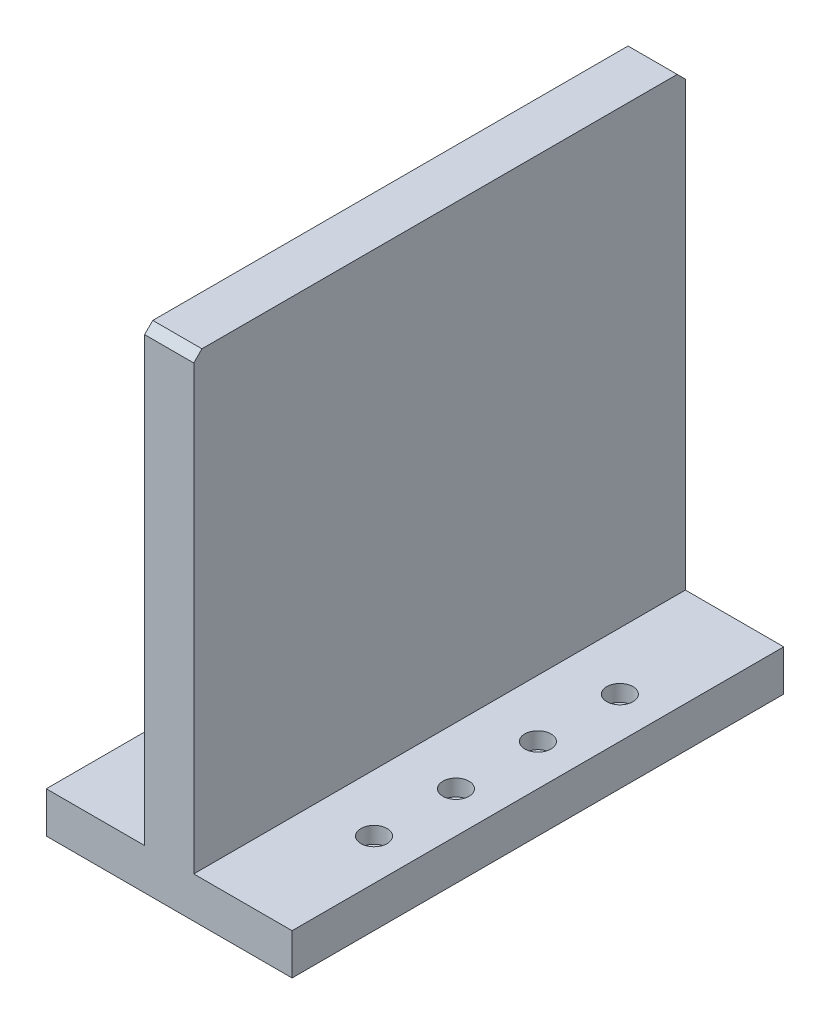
ISO-10303-21;
HEADER;
FILE_DESCRIPTION(('STEP AP214'),'2;1');
FILE_NAME('part.step','',(''),(''),'','','');
FILE_SCHEMA(('AUTOMOTIVE_DESIGN { 1 0 10303 214 1 1 1 1 }'));
ENDSEC;
DATA;
#1=APPLICATION_CONTEXT('core data for automotive mechanical design processes');
#2=APPLICATION_PROTOCOL_DEFINITION('international standard','automotive_design',2000,#1);
#3=PRODUCT_CONTEXT('',#1,'mechanical');
#4=PRODUCT('Part','Part','',(#3));
#5=PRODUCT_RELATED_PRODUCT_CATEGORY('part','',(#4));
#6=PRODUCT_DEFINITION_FORMATION('','',#4);
#7=PRODUCT_DEFINITION_CONTEXT('part definition',#1,'design');
#8=PRODUCT_DEFINITION('design','',#6,#7);
#9=PRODUCT_DEFINITION_SHAPE('','',#8);
#10=(LENGTH_UNIT() NAMED_UNIT(*) SI_UNIT(.MILLI.,.METRE.));
#11=(NAMED_UNIT(*) PLANE_ANGLE_UNIT() SI_UNIT($,.RADIAN.));
#12=(NAMED_UNIT(*) SI_UNIT($,.STERADIAN.) SOLID_ANGLE_UNIT());
#13=UNCERTAINTY_MEASURE_WITH_UNIT(LENGTH_MEASURE(1.E-05),#10,'distance_accuracy_value','');
#14=(GEOMETRIC_REPRESENTATION_CONTEXT(3) GLOBAL_UNCERTAINTY_ASSIGNED_CONTEXT((#13)) GLOBAL_UNIT_ASSIGNED_CONTEXT((#10,
#11,#12)) REPRESENTATION_CONTEXT('',''));
#15=CARTESIAN_POINT('',(0.,0.,0.));
#16=DIRECTION('',(0.,0.,1.));
#17=DIRECTION('',(1.,0.,0.));
#18=AXIS2_PLACEMENT_3D('',#15,#16,#17);
#19=CARTESIAN_POINT('',(-50.,30.,75.));
#20=DIRECTION('',(0.,-1.,0.));
#21=DIRECTION('',(0.,0.,-1.));
#22=AXIS2_PLACEMENT_3D('',#19,#20,#21);
#23=CYLINDRICAL_SURFACE('',#22,5.00000000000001);
#24=CARTESIAN_POINT('',(-50.,0.,75.));
#25=DIRECTION('',(0.,1.,0.));
#26=DIRECTION('',(0.,0.,1.));
#27=AXIS2_PLACEMENT_3D('',#24,#25,#26);
#28=CIRCLE('',#27,5.00000000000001);
#29=CARTESIAN_POINT('',(-50.,0.,80.));
#30=VERTEX_POINT('',#29);
#31=EDGE_CURVE('E193',#30,#30,#28,.T.);
#32=ORIENTED_EDGE('',*,*,#31,.F.);
#33=EDGE_LOOP('',(#32));
#34=FACE_BOUND('',#33,.T.);
#35=CARTESIAN_POINT('',(-50.,15.,75.));
#36=DIRECTION('',(0.,1.,0.));
#37=DIRECTION('',(-1.,0.,0.));
#38=AXIS2_PLACEMENT_3D('',#35,#36,#37);
#39=CIRCLE('',#38,5.00000000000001);
#40=CARTESIAN_POINT('',(-55.,15.,75.));
#41=VERTEX_POINT('',#40);
#42=EDGE_CURVE('E37',#41,#41,#39,.T.);
#43=ORIENTED_EDGE('',*,*,#42,.T.);
#44=EDGE_LOOP('',(#43));
#45=FACE_BOUND('',#44,.T.);
#46=ADVANCED_FACE('F33',(#34,#45),#23,.F.);
#47=CARTESIAN_POINT('',(50.,30.,75.));
#48=DIRECTION('',(0.,-1.,0.));
#49=DIRECTION('',(0.,0.,-1.));
#50=AXIS2_PLACEMENT_3D('',#47,#48,#49);
#51=CYLINDRICAL_SURFACE('',#50,5.);
#52=CARTESIAN_POINT('',(50.,0.,75.));
#53=DIRECTION('',(0.,1.,0.));
#54=DIRECTION('',(0.,0.,1.));
#55=AXIS2_PLACEMENT_3D('',#52,#53,#54);
#56=CIRCLE('',#55,5.);
#57=CARTESIAN_POINT('',(50.,0.,80.));
#58=VERTEX_POINT('',#57);
#59=EDGE_CURVE('E157',#58,#58,#56,.T.);
#60=ORIENTED_EDGE('',*,*,#59,.F.);
#61=EDGE_LOOP('',(#60));
#62=FACE_BOUND('',#61,.T.);
#63=CARTESIAN_POINT('',(50.,15.,75.));
#64=DIRECTION('',(0.,1.,0.));
#65=DIRECTION('',(-1.,0.,0.));
#66=AXIS2_PLACEMENT_3D('',#63,#64,#65);
#67=CIRCLE('',#66,5.);
#68=CARTESIAN_POINT('',(45.,15.,75.));
#69=VERTEX_POINT('',#68);
#70=EDGE_CURVE('E174',#69,#69,#67,.T.);
#71=ORIENTED_EDGE('',*,*,#70,.T.);
#72=EDGE_LOOP('',(#71));
#73=FACE_BOUND('',#72,.T.);
#74=ADVANCED_FACE('F280',(#62,#73),#51,.F.);
#75=CARTESIAN_POINT('',(50.,30.,125.));
#76=DIRECTION('',(0.,-1.,0.));
#77=DIRECTION('',(0.,0.,-1.));
#78=AXIS2_PLACEMENT_3D('',#75,#76,#77);
#79=CYLINDRICAL_SURFACE('',#78,5.00000000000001);
#80=CARTESIAN_POINT('',(50.,0.,125.));
#81=DIRECTION('',(0.,1.,0.));
#82=DIRECTION('',(0.,0.,1.));
#83=AXIS2_PLACEMENT_3D('',#80,#81,#82);
#84=CIRCLE('',#83,5.00000000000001);
#85=CARTESIAN_POINT('',(50.,0.,130.));
#86=VERTEX_POINT('',#85);
#87=EDGE_CURVE('E206',#86,#86,#84,.T.);
#88=ORIENTED_EDGE('',*,*,#87,.F.);
#89=EDGE_LOOP('',(#88));
#90=FACE_BOUND('',#89,.T.);
#91=CARTESIAN_POINT('',(50.,15.,125.));
#92=DIRECTION('',(0.,1.,0.));
#93=DIRECTION('',(-1.,0.,0.));
#94=AXIS2_PLACEMENT_3D('',#91,#92,#93);
#95=CIRCLE('',#94,5.00000000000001);
#96=CARTESIAN_POINT('',(45.,15.,125.));
#97=VERTEX_POINT('',#96);
#98=EDGE_CURVE('E172',#97,#97,#95,.T.);
#99=ORIENTED_EDGE('',*,*,#98,.T.);
#100=EDGE_LOOP('',(#99));
#101=FACE_BOUND('',#100,.T.);
#102=ADVANCED_FACE('F286',(#90,#101),#79,.F.);
#103=CARTESIAN_POINT('',(50.,30.,175.));
#104=DIRECTION('',(0.,-1.,0.));
#105=DIRECTION('',(0.,0.,-1.));
#106=AXIS2_PLACEMENT_3D('',#103,#104,#105);
#107=CYLINDRICAL_SURFACE('',#106,5.00000000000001);
#108=CARTESIAN_POINT('',(50.,0.,175.));
#109=DIRECTION('',(0.,1.,0.));
#110=DIRECTION('',(0.,0.,1.));
#111=AXIS2_PLACEMENT_3D('',#108,#109,#110);
#112=CIRCLE('',#111,5.00000000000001);
#113=CARTESIAN_POINT('',(50.,0.,180.));
#114=VERTEX_POINT('',#113);
#115=EDGE_CURVE('E203',#114,#114,#112,.T.);
#116=ORIENTED_EDGE('',*,*,#115,.F.);
#117=EDGE_LOOP('',(#116));
#118=FACE_BOUND('',#117,.T.);
#119=CARTESIAN_POINT('',(50.,15.,175.));
#120=DIRECTION('',(0.,1.,0.));
#121=DIRECTION('',(-1.,0.,0.));
#122=AXIS2_PLACEMENT_3D('',#119,#120,#121);
#123=CIRCLE('',#122,5.00000000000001);
#124=CARTESIAN_POINT('',(45.,15.,175.));
#125=VERTEX_POINT('',#124);
#126=EDGE_CURVE('E169',#125,#125,#123,.T.);
#127=ORIENTED_EDGE('',*,*,#126,.T.);
#128=EDGE_LOOP('',(#127));
#129=FACE_BOUND('',#128,.T.);
#130=ADVANCED_FACE('F543',(#118,#129),#107,.F.);
#131=CARTESIAN_POINT('',(-50.,30.,225.));
#132=DIRECTION('',(0.,-1.,0.));
#133=DIRECTION('',(0.,0.,-1.));
#134=AXIS2_PLACEMENT_3D('',#131,#132,#133);
#135=CYLINDRICAL_SURFACE('',#134,5.);
#136=CARTESIAN_POINT('',(-50.,0.,225.));
#137=DIRECTION('',(0.,1.,0.));
#138=DIRECTION('',(0.,0.,1.));
#139=AXIS2_PLACEMENT_3D('',#136,#137,#138);
#140=CIRCLE('',#139,5.);
#141=CARTESIAN_POINT('',(-50.,0.,230.));
#142=VERTEX_POINT('',#141);
#143=EDGE_CURVE('E197',#142,#142,#140,.T.);
#144=ORIENTED_EDGE('',*,*,#143,.F.);
#145=EDGE_LOOP('',(#144));
#146=FACE_BOUND('',#145,.T.);
#147=CARTESIAN_POINT('',(-50.,15.,225.));
#148=DIRECTION('',(0.,1.,0.));
#149=DIRECTION('',(-1.,0.,0.));
#150=AXIS2_PLACEMENT_3D('',#147,#148,#149);
#151=CIRCLE('',#150,5.);
#152=CARTESIAN_POINT('',(-55.,15.,225.));
#153=VERTEX_POINT('',#152);
#154=EDGE_CURVE('E166',#153,#153,#151,.T.);
#155=ORIENTED_EDGE('',*,*,#154,.T.);
#156=EDGE_LOOP('',(#155));
#157=FACE_BOUND('',#156,.T.);
#158=ADVANCED_FACE('F551',(#146,#157),#135,.F.);
#159=CARTESIAN_POINT('',(-50.,30.,175.));
#160=DIRECTION('',(0.,-1.,0.));
#161=DIRECTION('',(0.,0.,-1.));
#162=AXIS2_PLACEMENT_3D('',#159,#160,#161);
#163=CYLINDRICAL_SURFACE('',#162,5.);
#164=CARTESIAN_POINT('',(-50.,0.,175.));
#165=DIRECTION('',(0.,1.,0.));
#166=DIRECTION('',(0.,0.,1.));
#167=AXIS2_PLACEMENT_3D('',#164,#165,#166);
#168=CIRCLE('',#167,5.);
#169=CARTESIAN_POINT('',(-50.,0.,180.));
#170=VERTEX_POINT('',#169);
#171=EDGE_CURVE('E194',#170,#170,#168,.T.);
#172=ORIENTED_EDGE('',*,*,#171,.F.);
#173=EDGE_LOOP('',(#172));
#174=FACE_BOUND('',#173,.T.);
#175=CARTESIAN_POINT('',(-50.,15.,175.));
#176=DIRECTION('',(0.,1.,0.));
#177=DIRECTION('',(-1.,0.,0.));
#178=AXIS2_PLACEMENT_3D('',#175,#176,#177);
#179=CIRCLE('',#178,5.);
#180=CARTESIAN_POINT('',(-55.,15.,175.));
#181=VERTEX_POINT('',#180);
#182=EDGE_CURVE('E162',#181,#181,#179,.T.);
#183=ORIENTED_EDGE('',*,*,#182,.T.);
#184=EDGE_LOOP('',(#183));
#185=FACE_BOUND('',#184,.T.);
#186=ADVANCED_FACE('F560',(#174,#185),#163,.F.);
#187=CARTESIAN_POINT('',(-50.,30.,125.));
#188=DIRECTION('',(0.,-1.,0.));
#189=DIRECTION('',(0.,0.,-1.));
#190=AXIS2_PLACEMENT_3D('',#187,#188,#189);
#191=CYLINDRICAL_SURFACE('',#190,5.);
#192=CARTESIAN_POINT('',(-50.,0.,125.));
#193=DIRECTION('',(0.,1.,0.));
#194=DIRECTION('',(0.,0.,1.));
#195=AXIS2_PLACEMENT_3D('',#192,#193,#194);
#196=CIRCLE('',#195,5.);
#197=CARTESIAN_POINT('',(-50.,0.,130.));
#198=VERTEX_POINT('',#197);
#199=EDGE_CURVE('E190',#198,#198,#196,.T.);
#200=ORIENTED_EDGE('',*,*,#199,.F.);
#201=EDGE_LOOP('',(#200));
#202=FACE_BOUND('',#201,.T.);
#203=CARTESIAN_POINT('',(-50.,15.,125.));
#204=DIRECTION('',(0.,1.,0.));
#205=DIRECTION('',(-1.,0.,0.));
#206=AXIS2_PLACEMENT_3D('',#203,#204,#205);
#207=CIRCLE('',#206,5.);
#208=CARTESIAN_POINT('',(-55.,15.,125.));
#209=VERTEX_POINT('',#208);
#210=EDGE_CURVE('E159',#209,#209,#207,.T.);
#211=ORIENTED_EDGE('',*,*,#210,.T.);
#212=EDGE_LOOP('',(#211));
#213=FACE_BOUND('',#212,.T.);
#214=ADVANCED_FACE('F569',(#202,#213),#191,.F.);
#215=CARTESIAN_POINT('',(50.,30.,225.));
#216=DIRECTION('',(0.,-1.,0.));
#217=DIRECTION('',(0.,0.,-1.));
#218=AXIS2_PLACEMENT_3D('',#215,#216,#217);
#219=CYLINDRICAL_SURFACE('',#218,5.00000000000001);
#220=CARTESIAN_POINT('',(50.,0.,225.));
#221=DIRECTION('',(0.,1.,0.));
#222=DIRECTION('',(0.,0.,1.));
#223=AXIS2_PLACEMENT_3D('',#220,#221,#222);
#224=CIRCLE('',#223,5.00000000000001);
#225=CARTESIAN_POINT('',(50.,0.,230.));
#226=VERTEX_POINT('',#225);
#227=EDGE_CURVE('E200',#226,#226,#224,.T.);
#228=ORIENTED_EDGE('',*,*,#227,.F.);
#229=EDGE_LOOP('',(#228));
#230=FACE_BOUND('',#229,.T.);
#231=CARTESIAN_POINT('',(50.,15.,225.));
#232=DIRECTION('',(0.,1.,0.));
#233=DIRECTION('',(-1.,0.,0.));
#234=AXIS2_PLACEMENT_3D('',#231,#232,#233);
#235=CIRCLE('',#234,5.00000000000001);
#236=CARTESIAN_POINT('',(45.,15.,225.));
#237=VERTEX_POINT('',#236);
#238=EDGE_CURVE('E154',#237,#237,#235,.T.);
#239=ORIENTED_EDGE('',*,*,#238,.T.);
#240=EDGE_LOOP('',(#239));
#241=FACE_BOUND('',#240,.T.);
#242=ADVANCED_FACE('F578',(#230,#241),#219,.F.);
#243=CARTESIAN_POINT('',(-15.,25.,300.));
#244=DIRECTION('',(1.,0.,0.));
#245=DIRECTION('',(0.,0.,-1.));
#246=AXIS2_PLACEMENT_3D('',#243,#244,#245);
#247=PLANE('',#246);
#248=DIRECTION('',(0.,-1.,0.));
#249=VECTOR('',#248,1.);
#250=CARTESIAN_POINT('',(-15.,25.,300.));
#251=LINE('',#250,#249);
#252=CARTESIAN_POINT('',(-15.,295.,300.));
#253=VERTEX_POINT('',#252);
#254=CARTESIAN_POINT('',(-15.,25.,300.));
#255=VERTEX_POINT('',#254);
#256=EDGE_CURVE('E113',#253,#255,#251,.T.);
#257=ORIENTED_EDGE('',*,*,#256,.F.);
#258=DIRECTION('',(0.,-0.707106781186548,0.707106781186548));
#259=VECTOR('',#258,1.);
#260=CARTESIAN_POINT('',(-15.,295.,300.));
#261=LINE('',#260,#259);
#262=CARTESIAN_POINT('',(-15.,300.,295.));
#263=VERTEX_POINT('',#262);
#264=EDGE_CURVE('E145',#253,#263,#261,.F.);
#265=ORIENTED_EDGE('',*,*,#264,.T.);
#266=DIRECTION('',(0.,0.,-1.));
#267=VECTOR('',#266,1.);
#268=CARTESIAN_POINT('',(-15.,300.,300.));
#269=LINE('',#268,#267);
#270=CARTESIAN_POINT('',(-15.,300.,5.00000000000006));
#271=VERTEX_POINT('',#270);
#272=EDGE_CURVE('E222',#263,#271,#269,.T.);
#273=ORIENTED_EDGE('',*,*,#272,.T.);
#274=DIRECTION('',(0.,-0.707106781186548,-0.707106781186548));
#275=VECTOR('',#274,1.);
#276=CARTESIAN_POINT('',(-15.,300.,5.00000000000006));
#277=LINE('',#276,#275);
#278=CARTESIAN_POINT('',(-15.,295.,0.));
#279=VERTEX_POINT('',#278);
#280=EDGE_CURVE('E138',#271,#279,#277,.T.);
#281=ORIENTED_EDGE('',*,*,#280,.T.);
#282=DIRECTION('',(0.,-1.,0.));
#283=VECTOR('',#282,1.);
#284=CARTESIAN_POINT('',(-15.,25.,0.));
#285=LINE('',#284,#283);
#286=CARTESIAN_POINT('',(-15.,25.,0.));
#287=VERTEX_POINT('',#286);
#288=EDGE_CURVE('E135',#279,#287,#285,.T.);
#289=ORIENTED_EDGE('',*,*,#288,.T.);
#290=DIRECTION('',(0.,0.,-1.));
#291=VECTOR('',#290,1.);
#292=CARTESIAN_POINT('',(-15.,25.,300.));
#293=LINE('',#292,#291);
#294=EDGE_CURVE('E128',#255,#287,#293,.T.);
#295=ORIENTED_EDGE('',*,*,#294,.F.);
#296=EDGE_LOOP('',(#257,#265,#273,#281,#289,#295));
#297=FACE_BOUND('',#296,.T.);
#298=ADVANCED_FACE('F134',(#297),#247,.F.);
#299=CARTESIAN_POINT('',(-75.,25.,300.));
#300=DIRECTION('',(0.,-1.,0.));
#301=DIRECTION('',(0.,0.,-1.));
#302=AXIS2_PLACEMENT_3D('',#299,#300,#301);
#303=PLANE('',#302);
#304=CARTESIAN_POINT('',(-50.,25.,225.));
#305=DIRECTION('',(0.,1.,0.));
#306=DIRECTION('',(-1.,0.,0.));
#307=AXIS2_PLACEMENT_3D('',#304,#305,#306);
#308=CIRCLE('',#307,8.);
#309=CARTESIAN_POINT('',(-58.,25.,225.));
#310=VERTEX_POINT('',#309);
#311=EDGE_CURVE('E689',#310,#310,#308,.T.);
#312=ORIENTED_EDGE('',*,*,#311,.F.);
#313=EDGE_LOOP('',(#312));
#314=FACE_BOUND('',#313,.T.);
#315=CARTESIAN_POINT('',(-50.,25.,175.));
#316=DIRECTION('',(0.,1.,0.));
#317=DIRECTION('',(-1.,0.,0.));
#318=AXIS2_PLACEMENT_3D('',#315,#316,#317);
#319=CIRCLE('',#318,8.);
#320=CARTESIAN_POINT('',(-58.,25.,175.));
#321=VERTEX_POINT('',#320);
#322=EDGE_CURVE('E651',#321,#321,#319,.T.);
#323=ORIENTED_EDGE('',*,*,#322,.F.);
#324=EDGE_LOOP('',(#323));
#325=FACE_BOUND('',#324,.T.);
#326=CARTESIAN_POINT('',(-50.,25.,125.));
#327=DIRECTION('',(0.,1.,0.));
#328=DIRECTION('',(-1.,0.,0.));
#329=AXIS2_PLACEMENT_3D('',#326,#327,#328);
#330=CIRCLE('',#329,8.);
#331=CARTESIAN_POINT('',(-58.,25.,125.));
#332=VERTEX_POINT('',#331);
#333=EDGE_CURVE('E664',#332,#332,#330,.T.);
#334=ORIENTED_EDGE('',*,*,#333,.F.);
#335=EDGE_LOOP('',(#334));
#336=FACE_BOUND('',#335,.T.);
#337=CARTESIAN_POINT('',(-50.,25.,75.));
#338=DIRECTION('',(0.,1.,0.));
#339=DIRECTION('',(-1.,0.,0.));
#340=AXIS2_PLACEMENT_3D('',#337,#338,#339);
#341=CIRCLE('',#340,8.);
#342=CARTESIAN_POINT('',(-58.,25.,75.));
#343=VERTEX_POINT('',#342);
#344=EDGE_CURVE('E675',#343,#343,#341,.T.);
#345=ORIENTED_EDGE('',*,*,#344,.F.);
#346=EDGE_LOOP('',(#345));
#347=FACE_BOUND('',#346,.T.);
#348=DIRECTION('',(-1.,0.,0.));
#349=VECTOR('',#348,1.);
#350=CARTESIAN_POINT('',(-75.,25.,0.));
#351=LINE('',#350,#349);
#352=CARTESIAN_POINT('',(-75.,25.,0.));
#353=VERTEX_POINT('',#352);
#354=EDGE_CURVE('E224',#287,#353,#351,.T.);
#355=ORIENTED_EDGE('',*,*,#354,.T.);
#356=DIRECTION('',(0.,0.,-1.));
#357=VECTOR('',#356,1.);
#358=CARTESIAN_POINT('',(-75.,25.,300.));
#359=LINE('',#358,#357);
#360=CARTESIAN_POINT('',(-75.,25.,300.));
#361=VERTEX_POINT('',#360);
#362=EDGE_CURVE('E130',#361,#353,#359,.T.);
#363=ORIENTED_EDGE('',*,*,#362,.F.);
#364=DIRECTION('',(-1.,0.,0.));
#365=VECTOR('',#364,1.);
#366=CARTESIAN_POINT('',(-75.,25.,300.));
#367=LINE('',#366,#365);
#368=EDGE_CURVE('E117',#255,#361,#367,.T.);
#369=ORIENTED_EDGE('',*,*,#368,.F.);
#370=ORIENTED_EDGE('',*,*,#294,.T.);
#371=EDGE_LOOP('',(#355,#363,#369,#370));
#372=FACE_BOUND('',#371,.T.);
#373=ADVANCED_FACE('F127',(#314,#325,#336,#347,#372),#303,.F.);
#374=CARTESIAN_POINT('',(-75.,0.,300.));
#375=DIRECTION('',(1.,0.,0.));
#376=DIRECTION('',(0.,0.,-1.));
#377=AXIS2_PLACEMENT_3D('',#374,#375,#376);
#378=PLANE('',#377);
#379=DIRECTION('',(0.,-1.,0.));
#380=VECTOR('',#379,1.);
#381=CARTESIAN_POINT('',(-75.,0.,0.));
#382=LINE('',#381,#380);
#383=CARTESIAN_POINT('',(-75.,0.,0.));
#384=VERTEX_POINT('',#383);
#385=EDGE_CURVE('E226',#353,#384,#382,.T.);
#386=ORIENTED_EDGE('',*,*,#385,.T.);
#387=DIRECTION('',(0.,0.,-1.));
#388=VECTOR('',#387,1.);
#389=CARTESIAN_POINT('',(-75.,0.,300.));
#390=LINE('',#389,#388);
#391=CARTESIAN_POINT('',(-75.,0.,300.));
#392=VERTEX_POINT('',#391);
#393=EDGE_CURVE('E140',#392,#384,#390,.T.);
#394=ORIENTED_EDGE('',*,*,#393,.F.);
#395=DIRECTION('',(0.,-1.,0.));
#396=VECTOR('',#395,1.);
#397=CARTESIAN_POINT('',(-75.,0.,300.));
#398=LINE('',#397,#396);
#399=EDGE_CURVE('E132',#361,#392,#398,.T.);
#400=ORIENTED_EDGE('',*,*,#399,.F.);
#401=ORIENTED_EDGE('',*,*,#362,.T.);
#402=EDGE_LOOP('',(#386,#394,#400,#401));
#403=FACE_BOUND('',#402,.T.);
#404=ADVANCED_FACE('F268',(#403),#378,.F.);
#405=CARTESIAN_POINT('',(75.,0.,300.));
#406=DIRECTION('',(0.,1.,0.));
#407=DIRECTION('',(-1.,0.,0.));
#408=AXIS2_PLACEMENT_3D('',#405,#406,#407);
#409=PLANE('',#408);
#410=CARTESIAN_POINT('',(0.,0.,150.));
#411=DIRECTION('',(0.,1.,0.));
#412=DIRECTION('',(0.,0.,1.));
#413=AXIS2_PLACEMENT_3D('',#410,#411,#412);
#414=CIRCLE('',#413,10.);
#415=CARTESIAN_POINT('',(0.,0.,160.));
#416=VERTEX_POINT('',#415);
#417=EDGE_CURVE('E681',#416,#416,#414,.T.);
#418=ORIENTED_EDGE('',*,*,#417,.T.);
#419=EDGE_LOOP('',(#418));
#420=FACE_BOUND('',#419,.T.);
#421=ORIENTED_EDGE('',*,*,#199,.T.);
#422=EDGE_LOOP('',(#421));
#423=FACE_BOUND('',#422,.T.);
#424=ORIENTED_EDGE('',*,*,#171,.T.);
#425=EDGE_LOOP('',(#424));
#426=FACE_BOUND('',#425,.T.);
#427=ORIENTED_EDGE('',*,*,#143,.T.);
#428=EDGE_LOOP('',(#427));
#429=FACE_BOUND('',#428,.T.);
#430=ORIENTED_EDGE('',*,*,#227,.T.);
#431=EDGE_LOOP('',(#430));
#432=FACE_BOUND('',#431,.T.);
#433=ORIENTED_EDGE('',*,*,#115,.T.);
#434=EDGE_LOOP('',(#433));
#435=FACE_BOUND('',#434,.T.);
#436=ORIENTED_EDGE('',*,*,#87,.T.);
#437=EDGE_LOOP('',(#436));
#438=FACE_BOUND('',#437,.T.);
#439=ORIENTED_EDGE('',*,*,#59,.T.);
#440=EDGE_LOOP('',(#439));
#441=FACE_BOUND('',#440,.T.);
#442=ORIENTED_EDGE('',*,*,#31,.T.);
#443=EDGE_LOOP('',(#442));
#444=FACE_BOUND('',#443,.T.);
#445=DIRECTION('',(1.,0.,0.));
#446=VECTOR('',#445,1.);
#447=CARTESIAN_POINT('',(75.,0.,0.));
#448=LINE('',#447,#446);
#449=CARTESIAN_POINT('',(75.,0.,0.));
#450=VERTEX_POINT('',#449);
#451=EDGE_CURVE('E228',#384,#450,#448,.T.);
#452=ORIENTED_EDGE('',*,*,#451,.T.);
#453=DIRECTION('',(0.,0.,-1.));
#454=VECTOR('',#453,1.);
#455=CARTESIAN_POINT('',(75.,0.,300.));
#456=LINE('',#455,#454);
#457=CARTESIAN_POINT('',(75.,0.,300.));
#458=VERTEX_POINT('',#457);
#459=EDGE_CURVE('E245',#458,#450,#456,.T.);
#460=ORIENTED_EDGE('',*,*,#459,.F.);
#461=DIRECTION('',(1.,0.,0.));
#462=VECTOR('',#461,1.);
#463=CARTESIAN_POINT('',(75.,0.,300.));
#464=LINE('',#463,#462);
#465=EDGE_CURVE('E214',#392,#458,#464,.T.);
#466=ORIENTED_EDGE('',*,*,#465,.F.);
#467=ORIENTED_EDGE('',*,*,#393,.T.);
#468=EDGE_LOOP('',(#452,#460,#466,#467));
#469=FACE_BOUND('',#468,.T.);
#470=ADVANCED_FACE('F252',(#420,#423,#426,#429,#432,#435,#438,#441,#444,#469),#409,.F.);
#471=CARTESIAN_POINT('',(75.,25.,300.));
#472=DIRECTION('',(-1.,0.,0.));
#473=DIRECTION('',(0.,0.,1.));
#474=AXIS2_PLACEMENT_3D('',#471,#472,#473);
#475=PLANE('',#474);
#476=DIRECTION('',(0.,1.,0.));
#477=VECTOR('',#476,1.);
#478=CARTESIAN_POINT('',(75.,25.,0.));
#479=LINE('',#478,#477);
#480=CARTESIAN_POINT('',(75.,25.,0.));
#481=VERTEX_POINT('',#480);
#482=EDGE_CURVE('E230',#450,#481,#479,.T.);
#483=ORIENTED_EDGE('',*,*,#482,.T.);
#484=DIRECTION('',(0.,0.,-1.));
#485=VECTOR('',#484,1.);
#486=CARTESIAN_POINT('',(75.,25.,300.));
#487=LINE('',#486,#485);
#488=CARTESIAN_POINT('',(75.,25.,300.));
#489=VERTEX_POINT('',#488);
#490=EDGE_CURVE('E242',#489,#481,#487,.T.);
#491=ORIENTED_EDGE('',*,*,#490,.F.);
#492=DIRECTION('',(0.,1.,0.));
#493=VECTOR('',#492,1.);
#494=CARTESIAN_POINT('',(75.,25.,300.));
#495=LINE('',#494,#493);
#496=EDGE_CURVE('E216',#458,#489,#495,.T.);
#497=ORIENTED_EDGE('',*,*,#496,.F.);
#498=ORIENTED_EDGE('',*,*,#459,.T.);
#499=EDGE_LOOP('',(#483,#491,#497,#498));
#500=FACE_BOUND('',#499,.T.);
#501=ADVANCED_FACE('F261',(#500),#475,.F.);
#502=CARTESIAN_POINT('',(15.,25.,300.));
#503=DIRECTION('',(0.,-1.,0.));
#504=DIRECTION('',(1.,0.,0.));
#505=AXIS2_PLACEMENT_3D('',#502,#503,#504);
#506=PLANE('',#505);
#507=CARTESIAN_POINT('',(50.,25.,175.));
#508=DIRECTION('',(0.,1.,0.));
#509=DIRECTION('',(-1.,0.,0.));
#510=AXIS2_PLACEMENT_3D('',#507,#508,#509);
#511=CIRCLE('',#510,8.);
#512=CARTESIAN_POINT('',(42.,25.,175.));
#513=VERTEX_POINT('',#512);
#514=EDGE_CURVE('E695',#513,#513,#511,.T.);
#515=ORIENTED_EDGE('',*,*,#514,.F.);
#516=EDGE_LOOP('',(#515));
#517=FACE_BOUND('',#516,.T.);
#518=CARTESIAN_POINT('',(50.,25.,125.));
#519=DIRECTION('',(0.,1.,0.));
#520=DIRECTION('',(-1.,0.,0.));
#521=AXIS2_PLACEMENT_3D('',#518,#519,#520);
#522=CIRCLE('',#521,8.);
#523=CARTESIAN_POINT('',(42.,25.,125.));
#524=VERTEX_POINT('',#523);
#525=EDGE_CURVE('E652',#524,#524,#522,.T.);
#526=ORIENTED_EDGE('',*,*,#525,.F.);
#527=EDGE_LOOP('',(#526));
#528=FACE_BOUND('',#527,.T.);
#529=CARTESIAN_POINT('',(50.,25.,75.));
#530=DIRECTION('',(0.,1.,0.));
#531=DIRECTION('',(-1.,0.,0.));
#532=AXIS2_PLACEMENT_3D('',#529,#530,#531);
#533=CIRCLE('',#532,8.);
#534=CARTESIAN_POINT('',(42.,25.,75.));
#535=VERTEX_POINT('',#534);
#536=EDGE_CURVE('E670',#535,#535,#533,.T.);
#537=ORIENTED_EDGE('',*,*,#536,.F.);
#538=EDGE_LOOP('',(#537));
#539=FACE_BOUND('',#538,.T.);
#540=CARTESIAN_POINT('',(50.,25.,225.));
#541=DIRECTION('',(0.,1.,0.));
#542=DIRECTION('',(-1.,0.,0.));
#543=AXIS2_PLACEMENT_3D('',#540,#541,#542);
#544=CIRCLE('',#543,8.);
#545=CARTESIAN_POINT('',(42.,25.,225.));
#546=VERTEX_POINT('',#545);
#547=EDGE_CURVE('E179',#546,#546,#544,.T.);
#548=ORIENTED_EDGE('',*,*,#547,.F.);
#549=EDGE_LOOP('',(#548));
#550=FACE_BOUND('',#549,.T.);
#551=DIRECTION('',(-1.,0.,0.));
#552=VECTOR('',#551,1.);
#553=CARTESIAN_POINT('',(15.,25.,0.));
#554=LINE('',#553,#552);
#555=CARTESIAN_POINT('',(15.,25.,0.));
#556=VERTEX_POINT('',#555);
#557=EDGE_CURVE('E232',#481,#556,#554,.T.);
#558=ORIENTED_EDGE('',*,*,#557,.T.);
#559=DIRECTION('',(0.,0.,-1.));
#560=VECTOR('',#559,1.);
#561=CARTESIAN_POINT('',(15.,25.,300.));
#562=LINE('',#561,#560);
#563=CARTESIAN_POINT('',(15.,25.,300.));
#564=VERTEX_POINT('',#563);
#565=EDGE_CURVE('E239',#564,#556,#562,.T.);
#566=ORIENTED_EDGE('',*,*,#565,.F.);
#567=DIRECTION('',(-1.,0.,0.));
#568=VECTOR('',#567,1.);
#569=CARTESIAN_POINT('',(15.,25.,300.));
#570=LINE('',#569,#568);
#571=EDGE_CURVE('E218',#489,#564,#570,.T.);
#572=ORIENTED_EDGE('',*,*,#571,.F.);
#573=ORIENTED_EDGE('',*,*,#490,.T.);
#574=EDGE_LOOP('',(#558,#566,#572,#573));
#575=FACE_BOUND('',#574,.T.);
#576=ADVANCED_FACE('F265',(#517,#528,#539,#550,#575),#506,.F.);
#577=CARTESIAN_POINT('',(15.,300.,300.));
#578=DIRECTION('',(-1.,0.,0.));
#579=DIRECTION('',(0.,-1.,0.));
#580=AXIS2_PLACEMENT_3D('',#577,#578,#579);
#581=PLANE('',#580);
#582=DIRECTION('',(0.,0.,-1.));
#583=VECTOR('',#582,1.);
#584=CARTESIAN_POINT('',(15.,300.,300.));
#585=LINE('',#584,#583);
#586=CARTESIAN_POINT('',(15.,300.,295.));
#587=VERTEX_POINT('',#586);
#588=CARTESIAN_POINT('',(15.,300.,5.00000000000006));
#589=VERTEX_POINT('',#588);
#590=EDGE_CURVE('E237',#587,#589,#585,.T.);
#591=ORIENTED_EDGE('',*,*,#590,.F.);
#592=DIRECTION('',(0.,0.707106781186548,-0.707106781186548));
#593=VECTOR('',#592,1.);
#594=CARTESIAN_POINT('',(15.,295.,300.));
#595=LINE('',#594,#593);
#596=CARTESIAN_POINT('',(15.,295.,300.));
#597=VERTEX_POINT('',#596);
#598=EDGE_CURVE('E42',#587,#597,#595,.F.);
#599=ORIENTED_EDGE('',*,*,#598,.T.);
#600=DIRECTION('',(0.,1.,0.));
#601=VECTOR('',#600,1.);
#602=CARTESIAN_POINT('',(15.,300.,300.));
#603=LINE('',#602,#601);
#604=EDGE_CURVE('E220',#564,#597,#603,.T.);
#605=ORIENTED_EDGE('',*,*,#604,.F.);
#606=ORIENTED_EDGE('',*,*,#565,.T.);
#607=DIRECTION('',(0.,1.,0.));
#608=VECTOR('',#607,1.);
#609=CARTESIAN_POINT('',(15.,300.,0.));
#610=LINE('',#609,#608);
#611=CARTESIAN_POINT('',(15.,295.,0.));
#612=VERTEX_POINT('',#611);
#613=EDGE_CURVE('E123',#556,#612,#610,.T.);
#614=ORIENTED_EDGE('',*,*,#613,.T.);
#615=DIRECTION('',(0.,0.707106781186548,0.707106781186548));
#616=VECTOR('',#615,1.);
#617=CARTESIAN_POINT('',(15.,300.,5.00000000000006));
#618=LINE('',#617,#616);
#619=EDGE_CURVE('E55',#612,#589,#618,.T.);
#620=ORIENTED_EDGE('',*,*,#619,.T.);
#621=EDGE_LOOP('',(#591,#599,#605,#606,#614,#620));
#622=FACE_BOUND('',#621,.T.);
#623=ADVANCED_FACE('F300',(#622),#581,.F.);
#624=CARTESIAN_POINT('',(-15.,300.,300.));
#625=DIRECTION('',(0.,-1.,0.));
#626=DIRECTION('',(0.,0.,-1.));
#627=AXIS2_PLACEMENT_3D('',#624,#625,#626);
#628=PLANE('',#627);
#629=ORIENTED_EDGE('',*,*,#272,.F.);
#630=DIRECTION('',(1.,0.,0.));
#631=VECTOR('',#630,1.);
#632=CARTESIAN_POINT('',(-15.,300.,295.));
#633=LINE('',#632,#631);
#634=EDGE_CURVE('E150',#263,#587,#633,.T.);
#635=ORIENTED_EDGE('',*,*,#634,.T.);
#636=ORIENTED_EDGE('',*,*,#590,.T.);
#637=DIRECTION('',(-1.,0.,0.));
#638=VECTOR('',#637,1.);
#639=CARTESIAN_POINT('',(-15.,300.,5.00000000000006));
#640=LINE('',#639,#638);
#641=EDGE_CURVE('E147',#589,#271,#640,.T.);
#642=ORIENTED_EDGE('',*,*,#641,.T.);
#643=EDGE_LOOP('',(#629,#635,#636,#642));
#644=FACE_BOUND('',#643,.T.);
#645=ADVANCED_FACE('F294',(#644),#628,.F.);
#646=CARTESIAN_POINT('',(-15.,300.,300.));
#647=DIRECTION('',(0.,0.,-1.));
#648=DIRECTION('',(-1.,0.,0.));
#649=AXIS2_PLACEMENT_3D('',#646,#647,#648);
#650=PLANE('',#649);
#651=ORIENTED_EDGE('',*,*,#604,.T.);
#652=DIRECTION('',(-1.,0.,0.));
#653=VECTOR('',#652,1.);
#654=CARTESIAN_POINT('',(-15.,295.,300.));
#655=LINE('',#654,#653);
#656=EDGE_CURVE('E120',#597,#253,#655,.T.);
#657=ORIENTED_EDGE('',*,*,#656,.T.);
#658=ORIENTED_EDGE('',*,*,#256,.T.);
#659=ORIENTED_EDGE('',*,*,#368,.T.);
#660=ORIENTED_EDGE('',*,*,#399,.T.);
#661=ORIENTED_EDGE('',*,*,#465,.T.);
#662=ORIENTED_EDGE('',*,*,#496,.T.);
#663=ORIENTED_EDGE('',*,*,#571,.T.);
#664=EDGE_LOOP('',(#651,#657,#658,#659,#660,#661,#662,#663));
#665=FACE_BOUND('',#664,.T.);
#666=ADVANCED_FACE('F116',(#665),#650,.F.);
#667=CARTESIAN_POINT('',(-15.,300.,0.));
#668=DIRECTION('',(0.,0.,-1.));
#669=DIRECTION('',(-1.,0.,0.));
#670=AXIS2_PLACEMENT_3D('',#667,#668,#669);
#671=PLANE('',#670);
#672=ORIENTED_EDGE('',*,*,#288,.F.);
#673=DIRECTION('',(1.,0.,0.));
#674=VECTOR('',#673,1.);
#675=CARTESIAN_POINT('',(15.,295.,0.));
#676=LINE('',#675,#674);
#677=EDGE_CURVE('E11',#279,#612,#676,.T.);
#678=ORIENTED_EDGE('',*,*,#677,.T.);
#679=ORIENTED_EDGE('',*,*,#613,.F.);
#680=ORIENTED_EDGE('',*,*,#557,.F.);
#681=ORIENTED_EDGE('',*,*,#482,.F.);
#682=ORIENTED_EDGE('',*,*,#451,.F.);
#683=ORIENTED_EDGE('',*,*,#385,.F.);
#684=ORIENTED_EDGE('',*,*,#354,.F.);
#685=EDGE_LOOP('',(#672,#678,#679,#680,#681,#682,#683,#684));
#686=FACE_BOUND('',#685,.T.);
#687=ADVANCED_FACE('F257',(#686),#671,.T.);
#688=CARTESIAN_POINT('',(-15.,295.,300.));
#689=DIRECTION('',(0.,-0.707106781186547,-0.707106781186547));
#690=DIRECTION('',(0.,0.707106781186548,-0.707106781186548));
#691=AXIS2_PLACEMENT_3D('',#688,#689,#690);
#692=PLANE('',#691);
#693=ORIENTED_EDGE('',*,*,#598,.F.);
#694=ORIENTED_EDGE('',*,*,#634,.F.);
#695=ORIENTED_EDGE('',*,*,#264,.F.);
#696=ORIENTED_EDGE('',*,*,#656,.F.);
#697=EDGE_LOOP('',(#693,#694,#695,#696));
#698=FACE_BOUND('',#697,.T.);
#699=ADVANCED_FACE('F297',(#698),#692,.F.);
#700=CARTESIAN_POINT('',(-15.,300.,5.00000000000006));
#701=DIRECTION('',(0.,0.707106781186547,-0.707106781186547));
#702=DIRECTION('',(0.,0.707106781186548,0.707106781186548));
#703=AXIS2_PLACEMENT_3D('',#700,#701,#702);
#704=PLANE('',#703);
#705=ORIENTED_EDGE('',*,*,#619,.F.);
#706=ORIENTED_EDGE('',*,*,#677,.F.);
#707=ORIENTED_EDGE('',*,*,#280,.F.);
#708=ORIENTED_EDGE('',*,*,#641,.F.);
#709=EDGE_LOOP('',(#705,#706,#707,#708));
#710=FACE_BOUND('',#709,.T.);
#711=ADVANCED_FACE('F35',(#710),#704,.T.);
#712=CARTESIAN_POINT('',(50.,15.,225.));
#713=DIRECTION('',(0.,1.,0.));
#714=DIRECTION('',(-1.,0.,0.));
#715=AXIS2_PLACEMENT_3D('',#712,#713,#714);
#716=CYLINDRICAL_SURFACE('',#715,8.);
#717=CARTESIAN_POINT('',(50.,15.,225.));
#718=DIRECTION('',(0.,1.,0.));
#719=DIRECTION('',(-1.,0.,0.));
#720=AXIS2_PLACEMENT_3D('',#717,#718,#719);
#721=CIRCLE('',#720,8.);
#722=CARTESIAN_POINT('',(42.,15.,225.));
#723=VERTEX_POINT('',#722);
#724=EDGE_CURVE('E158',#723,#723,#721,.T.);
#725=ORIENTED_EDGE('',*,*,#724,.F.);
#726=EDGE_LOOP('',(#725));
#727=FACE_BOUND('',#726,.T.);
#728=ORIENTED_EDGE('',*,*,#547,.T.);
#729=EDGE_LOOP('',(#728));
#730=FACE_BOUND('',#729,.T.);
#731=ADVANCED_FACE('F347',(#727,#730),#716,.F.);
#732=CARTESIAN_POINT('',(50.,15.,225.));
#733=DIRECTION('',(0.,1.,0.));
#734=DIRECTION('',(-1.,0.,0.));
#735=AXIS2_PLACEMENT_3D('',#732,#733,#734);
#736=PLANE('',#735);
#737=ORIENTED_EDGE('',*,*,#238,.F.);
#738=EDGE_LOOP('',(#737));
#739=FACE_BOUND('',#738,.T.);
#740=ORIENTED_EDGE('',*,*,#724,.T.);
#741=EDGE_LOOP('',(#740));
#742=FACE_BOUND('',#741,.T.);
#743=ADVANCED_FACE('F353',(#739,#742),#736,.T.);
#744=CARTESIAN_POINT('',(-50.,15.,125.));
#745=DIRECTION('',(0.,1.,0.));
#746=DIRECTION('',(-1.,0.,0.));
#747=AXIS2_PLACEMENT_3D('',#744,#745,#746);
#748=CYLINDRICAL_SURFACE('',#747,8.);
#749=CARTESIAN_POINT('',(-50.,15.,125.));
#750=DIRECTION('',(0.,1.,0.));
#751=DIRECTION('',(-1.,0.,0.));
#752=AXIS2_PLACEMENT_3D('',#749,#750,#751);
#753=CIRCLE('',#752,8.);
#754=CARTESIAN_POINT('',(-58.,15.,125.));
#755=VERTEX_POINT('',#754);
#756=EDGE_CURVE('E658',#755,#755,#753,.T.);
#757=ORIENTED_EDGE('',*,*,#756,.F.);
#758=EDGE_LOOP('',(#757));
#759=FACE_BOUND('',#758,.T.);
#760=ORIENTED_EDGE('',*,*,#333,.T.);
#761=EDGE_LOOP('',(#760));
#762=FACE_BOUND('',#761,.T.);
#763=ADVANCED_FACE('F361',(#759,#762),#748,.F.);
#764=CARTESIAN_POINT('',(-50.,15.,125.));
#765=DIRECTION('',(0.,1.,0.));
#766=DIRECTION('',(-1.,0.,0.));
#767=AXIS2_PLACEMENT_3D('',#764,#765,#766);
#768=PLANE('',#767);
#769=ORIENTED_EDGE('',*,*,#210,.F.);
#770=EDGE_LOOP('',(#769));
#771=FACE_BOUND('',#770,.T.);
#772=ORIENTED_EDGE('',*,*,#756,.T.);
#773=EDGE_LOOP('',(#772));
#774=FACE_BOUND('',#773,.T.);
#775=ADVANCED_FACE('F369',(#771,#774),#768,.T.);
#776=CARTESIAN_POINT('',(-50.,15.,175.));
#777=DIRECTION('',(0.,1.,0.));
#778=DIRECTION('',(-1.,0.,0.));
#779=AXIS2_PLACEMENT_3D('',#776,#777,#778);
#780=CYLINDRICAL_SURFACE('',#779,8.);
#781=CARTESIAN_POINT('',(-50.,15.,175.));
#782=DIRECTION('',(0.,1.,0.));
#783=DIRECTION('',(-1.,0.,0.));
#784=AXIS2_PLACEMENT_3D('',#781,#782,#783);
#785=CIRCLE('',#784,8.);
#786=CARTESIAN_POINT('',(-58.,15.,175.));
#787=VERTEX_POINT('',#786);
#788=EDGE_CURVE('E655',#787,#787,#785,.T.);
#789=ORIENTED_EDGE('',*,*,#788,.F.);
#790=EDGE_LOOP('',(#789));
#791=FACE_BOUND('',#790,.T.);
#792=ORIENTED_EDGE('',*,*,#322,.T.);
#793=EDGE_LOOP('',(#792));
#794=FACE_BOUND('',#793,.T.);
#795=ADVANCED_FACE('F377',(#791,#794),#780,.F.);
#796=CARTESIAN_POINT('',(-50.,15.,175.));
#797=DIRECTION('',(0.,1.,0.));
#798=DIRECTION('',(-1.,0.,0.));
#799=AXIS2_PLACEMENT_3D('',#796,#797,#798);
#800=PLANE('',#799);
#801=ORIENTED_EDGE('',*,*,#182,.F.);
#802=EDGE_LOOP('',(#801));
#803=FACE_BOUND('',#802,.T.);
#804=ORIENTED_EDGE('',*,*,#788,.T.);
#805=EDGE_LOOP('',(#804));
#806=FACE_BOUND('',#805,.T.);
#807=ADVANCED_FACE('F385',(#803,#806),#800,.T.);
#808=CARTESIAN_POINT('',(-50.,15.,225.));
#809=DIRECTION('',(0.,1.,0.));
#810=DIRECTION('',(-1.,0.,0.));
#811=AXIS2_PLACEMENT_3D('',#808,#809,#810);
#812=CYLINDRICAL_SURFACE('',#811,8.);
#813=CARTESIAN_POINT('',(-50.,15.,225.));
#814=DIRECTION('',(0.,1.,0.));
#815=DIRECTION('',(-1.,0.,0.));
#816=AXIS2_PLACEMENT_3D('',#813,#814,#815);
#817=CIRCLE('',#816,8.);
#818=CARTESIAN_POINT('',(-58.,15.,225.));
#819=VERTEX_POINT('',#818);
#820=EDGE_CURVE('E163',#819,#819,#817,.T.);
#821=ORIENTED_EDGE('',*,*,#820,.F.);
#822=EDGE_LOOP('',(#821));
#823=FACE_BOUND('',#822,.T.);
#824=ORIENTED_EDGE('',*,*,#311,.T.);
#825=EDGE_LOOP('',(#824));
#826=FACE_BOUND('',#825,.T.);
#827=ADVANCED_FACE('F393',(#823,#826),#812,.F.);
#828=CARTESIAN_POINT('',(-50.,15.,225.));
#829=DIRECTION('',(0.,1.,0.));
#830=DIRECTION('',(-1.,0.,0.));
#831=AXIS2_PLACEMENT_3D('',#828,#829,#830);
#832=PLANE('',#831);
#833=ORIENTED_EDGE('',*,*,#154,.F.);
#834=EDGE_LOOP('',(#833));
#835=FACE_BOUND('',#834,.T.);
#836=ORIENTED_EDGE('',*,*,#820,.T.);
#837=EDGE_LOOP('',(#836));
#838=FACE_BOUND('',#837,.T.);
#839=ADVANCED_FACE('F401',(#835,#838),#832,.T.);
#840=CARTESIAN_POINT('',(50.,15.,175.));
#841=DIRECTION('',(0.,1.,0.));
#842=DIRECTION('',(-1.,0.,0.));
#843=AXIS2_PLACEMENT_3D('',#840,#841,#842);
#844=CYLINDRICAL_SURFACE('',#843,8.);
#845=CARTESIAN_POINT('',(50.,15.,175.));
#846=DIRECTION('',(0.,1.,0.));
#847=DIRECTION('',(-1.,0.,0.));
#848=AXIS2_PLACEMENT_3D('',#845,#846,#847);
#849=CIRCLE('',#848,8.);
#850=CARTESIAN_POINT('',(42.,15.,175.));
#851=VERTEX_POINT('',#850);
#852=EDGE_CURVE('E692',#851,#851,#849,.T.);
#853=ORIENTED_EDGE('',*,*,#852,.F.);
#854=EDGE_LOOP('',(#853));
#855=FACE_BOUND('',#854,.T.);
#856=ORIENTED_EDGE('',*,*,#514,.T.);
#857=EDGE_LOOP('',(#856));
#858=FACE_BOUND('',#857,.T.);
#859=ADVANCED_FACE('F409',(#855,#858),#844,.F.);
#860=CARTESIAN_POINT('',(50.,15.,175.));
#861=DIRECTION('',(0.,1.,0.));
#862=DIRECTION('',(-1.,0.,0.));
#863=AXIS2_PLACEMENT_3D('',#860,#861,#862);
#864=PLANE('',#863);
#865=ORIENTED_EDGE('',*,*,#126,.F.);
#866=EDGE_LOOP('',(#865));
#867=FACE_BOUND('',#866,.T.);
#868=ORIENTED_EDGE('',*,*,#852,.T.);
#869=EDGE_LOOP('',(#868));
#870=FACE_BOUND('',#869,.T.);
#871=ADVANCED_FACE('F417',(#867,#870),#864,.T.);
#872=CARTESIAN_POINT('',(50.,15.,125.));
#873=DIRECTION('',(0.,1.,0.));
#874=DIRECTION('',(-1.,0.,0.));
#875=AXIS2_PLACEMENT_3D('',#872,#873,#874);
#876=CYLINDRICAL_SURFACE('',#875,8.);
#877=CARTESIAN_POINT('',(50.,15.,125.));
#878=DIRECTION('',(0.,1.,0.));
#879=DIRECTION('',(-1.,0.,0.));
#880=AXIS2_PLACEMENT_3D('',#877,#878,#879);
#881=CIRCLE('',#880,8.);
#882=CARTESIAN_POINT('',(42.,15.,125.));
#883=VERTEX_POINT('',#882);
#884=EDGE_CURVE('E650',#883,#883,#881,.T.);
#885=ORIENTED_EDGE('',*,*,#884,.F.);
#886=EDGE_LOOP('',(#885));
#887=FACE_BOUND('',#886,.T.);
#888=ORIENTED_EDGE('',*,*,#525,.T.);
#889=EDGE_LOOP('',(#888));
#890=FACE_BOUND('',#889,.T.);
#891=ADVANCED_FACE('F425',(#887,#890),#876,.F.);
#892=CARTESIAN_POINT('',(50.,15.,125.));
#893=DIRECTION('',(0.,1.,0.));
#894=DIRECTION('',(-1.,0.,0.));
#895=AXIS2_PLACEMENT_3D('',#892,#893,#894);
#896=PLANE('',#895);
#897=ORIENTED_EDGE('',*,*,#98,.F.);
#898=EDGE_LOOP('',(#897));
#899=FACE_BOUND('',#898,.T.);
#900=ORIENTED_EDGE('',*,*,#884,.T.);
#901=EDGE_LOOP('',(#900));
#902=FACE_BOUND('',#901,.T.);
#903=ADVANCED_FACE('F433',(#899,#902),#896,.T.);
#904=CARTESIAN_POINT('',(50.,15.,75.));
#905=DIRECTION('',(0.,1.,0.));
#906=DIRECTION('',(-1.,0.,0.));
#907=AXIS2_PLACEMENT_3D('',#904,#905,#906);
#908=CYLINDRICAL_SURFACE('',#907,8.);
#909=CARTESIAN_POINT('',(50.,15.,75.));
#910=DIRECTION('',(0.,1.,0.));
#911=DIRECTION('',(-1.,0.,0.));
#912=AXIS2_PLACEMENT_3D('',#909,#910,#911);
#913=CIRCLE('',#912,8.);
#914=CARTESIAN_POINT('',(42.,15.,75.));
#915=VERTEX_POINT('',#914);
#916=EDGE_CURVE('E667',#915,#915,#913,.T.);
#917=ORIENTED_EDGE('',*,*,#916,.F.);
#918=EDGE_LOOP('',(#917));
#919=FACE_BOUND('',#918,.T.);
#920=ORIENTED_EDGE('',*,*,#536,.T.);
#921=EDGE_LOOP('',(#920));
#922=FACE_BOUND('',#921,.T.);
#923=ADVANCED_FACE('F441',(#919,#922),#908,.F.);
#924=CARTESIAN_POINT('',(50.,15.,75.));
#925=DIRECTION('',(0.,1.,0.));
#926=DIRECTION('',(-1.,0.,0.));
#927=AXIS2_PLACEMENT_3D('',#924,#925,#926);
#928=PLANE('',#927);
#929=ORIENTED_EDGE('',*,*,#70,.F.);
#930=EDGE_LOOP('',(#929));
#931=FACE_BOUND('',#930,.T.);
#932=ORIENTED_EDGE('',*,*,#916,.T.);
#933=EDGE_LOOP('',(#932));
#934=FACE_BOUND('',#933,.T.);
#935=ADVANCED_FACE('F449',(#931,#934),#928,.T.);
#936=CARTESIAN_POINT('',(-50.,15.,75.));
#937=DIRECTION('',(0.,1.,0.));
#938=DIRECTION('',(-1.,0.,0.));
#939=AXIS2_PLACEMENT_3D('',#936,#937,#938);
#940=CYLINDRICAL_SURFACE('',#939,8.);
#941=CARTESIAN_POINT('',(-50.,15.,75.));
#942=DIRECTION('',(0.,1.,0.));
#943=DIRECTION('',(-1.,0.,0.));
#944=AXIS2_PLACEMENT_3D('',#941,#942,#943);
#945=CIRCLE('',#944,8.);
#946=CARTESIAN_POINT('',(-58.,15.,75.));
#947=VERTEX_POINT('',#946);
#948=EDGE_CURVE('E673',#947,#947,#945,.T.);
#949=ORIENTED_EDGE('',*,*,#948,.F.);
#950=EDGE_LOOP('',(#949));
#951=FACE_BOUND('',#950,.T.);
#952=ORIENTED_EDGE('',*,*,#344,.T.);
#953=EDGE_LOOP('',(#952));
#954=FACE_BOUND('',#953,.T.);
#955=ADVANCED_FACE('F457',(#951,#954),#940,.F.);
#956=CARTESIAN_POINT('',(-50.,15.,75.));
#957=DIRECTION('',(0.,1.,0.));
#958=DIRECTION('',(-1.,0.,0.));
#959=AXIS2_PLACEMENT_3D('',#956,#957,#958);
#960=PLANE('',#959);
#961=ORIENTED_EDGE('',*,*,#42,.F.);
#962=EDGE_LOOP('',(#961));
#963=FACE_BOUND('',#962,.T.);
#964=ORIENTED_EDGE('',*,*,#948,.T.);
#965=EDGE_LOOP('',(#964));
#966=FACE_BOUND('',#965,.T.);
#967=ADVANCED_FACE('F465',(#963,#966),#960,.T.);
#968=CARTESIAN_POINT('',(0.,20.,150.));
#969=DIRECTION('',(0.,-1.,0.));
#970=DIRECTION('',(0.,0.,-1.));
#971=AXIS2_PLACEMENT_3D('',#968,#969,#970);
#972=CYLINDRICAL_SURFACE('',#971,10.);
#973=CARTESIAN_POINT('',(0.,20.,150.));
#974=DIRECTION('',(0.,1.,0.));
#975=DIRECTION('',(0.,0.,1.));
#976=AXIS2_PLACEMENT_3D('',#973,#974,#975);
#977=CIRCLE('',#976,10.);
#978=CARTESIAN_POINT('',(0.,20.,160.));
#979=VERTEX_POINT('',#978);
#980=EDGE_CURVE('E677',#979,#979,#977,.T.);
#981=ORIENTED_EDGE('',*,*,#980,.T.);
#982=EDGE_LOOP('',(#981));
#983=FACE_BOUND('',#982,.T.);
#984=ORIENTED_EDGE('',*,*,#417,.F.);
#985=EDGE_LOOP('',(#984));
#986=FACE_BOUND('',#985,.T.);
#987=ADVANCED_FACE('F473',(#983,#986),#972,.F.);
#988=CARTESIAN_POINT('',(0.,20.,150.));
#989=DIRECTION('',(0.,1.,0.));
#990=DIRECTION('',(0.,0.,1.));
#991=AXIS2_PLACEMENT_3D('',#988,#989,#990);
#992=PLANE('',#991);
#993=ORIENTED_EDGE('',*,*,#980,.F.);
#994=EDGE_LOOP('',(#993));
#995=FACE_BOUND('',#994,.T.);
#996=ADVANCED_FACE('F481',(#995),#992,.F.);
#997=CLOSED_SHELL('',(#46,#74,#102,#130,#158,#186,#214,#242,#298,#373,#404,#470,#501,#576,#623,
#645,#666,#687,#699,#711,#731,#743,#763,#775,#795,#807,#827,#839,#859,#871,#891,#903,#923,#935,
#955,#967,#987,#996));
#998=MANIFOLD_SOLID_BREP('B2',#997);
#999=ADVANCED_BREP_SHAPE_REPRESENTATION('',(#18,#998),#14);
#1000=SHAPE_DEFINITION_REPRESENTATION(#9,#999);
ENDSEC;
END-ISO-10303-21;
